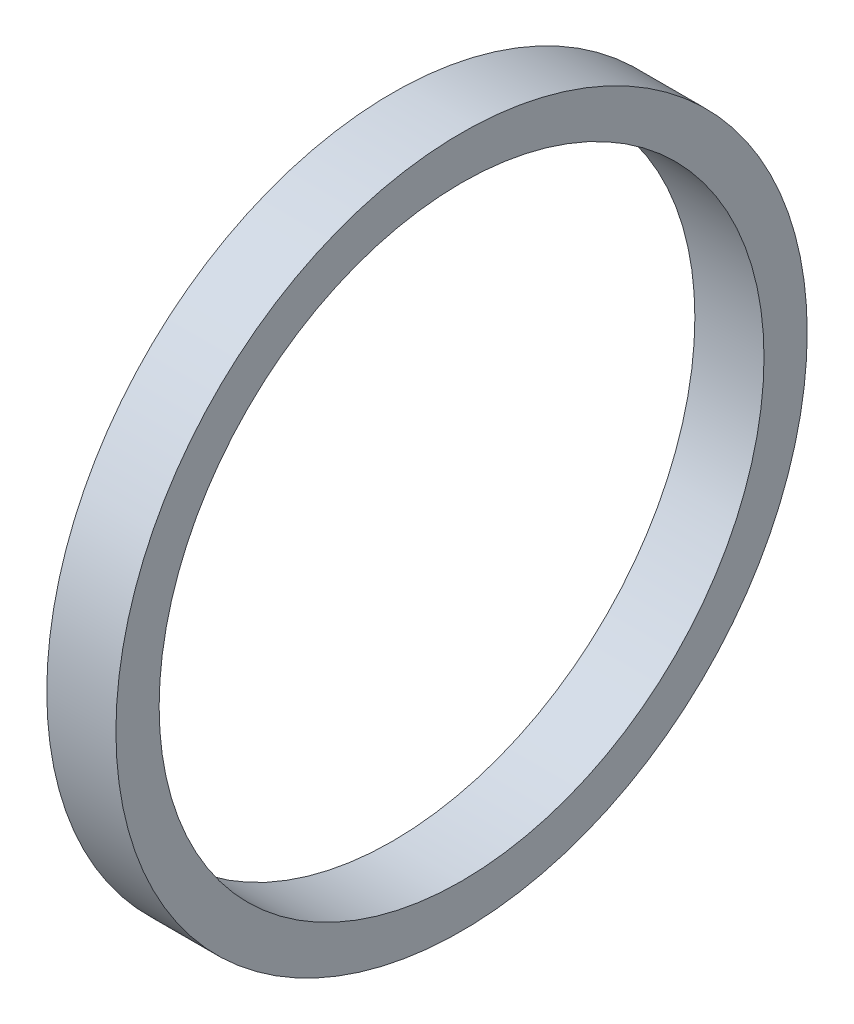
ISO-10303-21;
HEADER;
FILE_DESCRIPTION(('STEP AP214'),'2;1');
FILE_NAME('part.step','',(''),(''),'','','');
FILE_SCHEMA(('AUTOMOTIVE_DESIGN { 1 0 10303 214 1 1 1 1 }'));
ENDSEC;
DATA;
#1=APPLICATION_CONTEXT('core data for automotive mechanical design processes');
#2=APPLICATION_PROTOCOL_DEFINITION('international standard','automotive_design',2000,#1);
#3=PRODUCT_CONTEXT('',#1,'mechanical');
#4=PRODUCT('Part','Part','',(#3));
#5=PRODUCT_RELATED_PRODUCT_CATEGORY('part','',(#4));
#6=PRODUCT_DEFINITION_FORMATION('','',#4);
#7=PRODUCT_DEFINITION_CONTEXT('part definition',#1,'design');
#8=PRODUCT_DEFINITION('design','',#6,#7);
#9=PRODUCT_DEFINITION_SHAPE('','',#8);
#10=(LENGTH_UNIT() NAMED_UNIT(*) SI_UNIT(.MILLI.,.METRE.));
#11=(NAMED_UNIT(*) PLANE_ANGLE_UNIT() SI_UNIT($,.RADIAN.));
#12=(NAMED_UNIT(*) SI_UNIT($,.STERADIAN.) SOLID_ANGLE_UNIT());
#13=UNCERTAINTY_MEASURE_WITH_UNIT(LENGTH_MEASURE(1.E-05),#10,'distance_accuracy_value','');
#14=(GEOMETRIC_REPRESENTATION_CONTEXT(3) GLOBAL_UNCERTAINTY_ASSIGNED_CONTEXT((#13)) GLOBAL_UNIT_ASSIGNED_CONTEXT((#10,
#11,#12)) REPRESENTATION_CONTEXT('',''));
#15=CARTESIAN_POINT('',(0.,0.,0.));
#16=DIRECTION('',(0.,0.,1.));
#17=DIRECTION('',(1.,0.,0.));
#18=AXIS2_PLACEMENT_3D('',#15,#16,#17);
#19=CARTESIAN_POINT('',(-16.,80.,0.));
#20=DIRECTION('',(-1.,0.,0.));
#21=DIRECTION('',(0.,0.,1.));
#22=AXIS2_PLACEMENT_3D('',#19,#20,#21);
#23=PLANE('',#22);
#24=CARTESIAN_POINT('',(-16.,0.,0.));
#25=DIRECTION('',(1.,0.,0.));
#26=DIRECTION('',(0.,0.,-1.));
#27=AXIS2_PLACEMENT_3D('',#24,#25,#26);
#28=CIRCLE('',#27,70.);
#29=CARTESIAN_POINT('',(-16.,0.,-70.));
#30=VERTEX_POINT('',#29);
#31=EDGE_CURVE('E10',#30,#30,#28,.T.);
#32=ORIENTED_EDGE('',*,*,#31,.T.);
#33=EDGE_LOOP('',(#32));
#34=FACE_BOUND('',#33,.T.);
#35=CARTESIAN_POINT('',(-16.,0.,0.));
#36=DIRECTION('',(1.,0.,0.));
#37=DIRECTION('',(0.,0.,-1.));
#38=AXIS2_PLACEMENT_3D('',#35,#36,#37);
#39=CIRCLE('',#38,80.);
#40=CARTESIAN_POINT('',(-16.,0.,-80.));
#41=VERTEX_POINT('',#40);
#42=EDGE_CURVE('E44',#41,#41,#39,.T.);
#43=ORIENTED_EDGE('',*,*,#42,.F.);
#44=EDGE_LOOP('',(#43));
#45=FACE_BOUND('',#44,.T.);
#46=ADVANCED_FACE('F30',(#34,#45),#23,.T.);
#47=CARTESIAN_POINT('',(0.,0.,0.));
#48=DIRECTION('',(1.,0.,0.));
#49=DIRECTION('',(0.,0.,-1.));
#50=AXIS2_PLACEMENT_3D('',#47,#48,#49);
#51=CYLINDRICAL_SURFACE('',#50,70.);
#52=CARTESIAN_POINT('',(0.,0.,0.));
#53=DIRECTION('',(1.,0.,0.));
#54=DIRECTION('',(0.,0.,-1.));
#55=AXIS2_PLACEMENT_3D('',#52,#53,#54);
#56=CIRCLE('',#55,70.);
#57=CARTESIAN_POINT('',(0.,0.,-70.));
#58=VERTEX_POINT('',#57);
#59=EDGE_CURVE('E36',#58,#58,#56,.T.);
#60=ORIENTED_EDGE('',*,*,#59,.T.);
#61=EDGE_LOOP('',(#60));
#62=FACE_BOUND('',#61,.T.);
#63=ORIENTED_EDGE('',*,*,#31,.F.);
#64=EDGE_LOOP('',(#63));
#65=FACE_BOUND('',#64,.T.);
#66=ADVANCED_FACE('F54',(#62,#65),#51,.F.);
#67=CARTESIAN_POINT('',(0.,70.,0.));
#68=DIRECTION('',(1.,0.,0.));
#69=DIRECTION('',(0.,0.,-1.));
#70=AXIS2_PLACEMENT_3D('',#67,#68,#69);
#71=PLANE('',#70);
#72=CARTESIAN_POINT('',(0.,0.,0.));
#73=DIRECTION('',(1.,0.,0.));
#74=DIRECTION('',(0.,0.,-1.));
#75=AXIS2_PLACEMENT_3D('',#72,#73,#74);
#76=CIRCLE('',#75,80.);
#77=CARTESIAN_POINT('',(0.,0.,-80.));
#78=VERTEX_POINT('',#77);
#79=EDGE_CURVE('E40',#78,#78,#76,.T.);
#80=ORIENTED_EDGE('',*,*,#79,.T.);
#81=EDGE_LOOP('',(#80));
#82=FACE_BOUND('',#81,.T.);
#83=ORIENTED_EDGE('',*,*,#59,.F.);
#84=EDGE_LOOP('',(#83));
#85=FACE_BOUND('',#84,.T.);
#86=ADVANCED_FACE('F58',(#82,#85),#71,.T.);
#87=CARTESIAN_POINT('',(0.,0.,0.));
#88=DIRECTION('',(1.,0.,0.));
#89=DIRECTION('',(0.,0.,-1.));
#90=AXIS2_PLACEMENT_3D('',#87,#88,#89);
#91=CYLINDRICAL_SURFACE('',#90,80.);
#92=ORIENTED_EDGE('',*,*,#42,.T.);
#93=EDGE_LOOP('',(#92));
#94=FACE_BOUND('',#93,.T.);
#95=ORIENTED_EDGE('',*,*,#79,.F.);
#96=EDGE_LOOP('',(#95));
#97=FACE_BOUND('',#96,.T.);
#98=ADVANCED_FACE('F50',(#94,#97),#91,.T.);
#99=CLOSED_SHELL('',(#46,#66,#86,#98));
#100=MANIFOLD_SOLID_BREP('B2',#99);
#101=ADVANCED_BREP_SHAPE_REPRESENTATION('',(#18,#100),#14);
#102=SHAPE_DEFINITION_REPRESENTATION(#9,#101);
ENDSEC;
END-ISO-10303-21;
